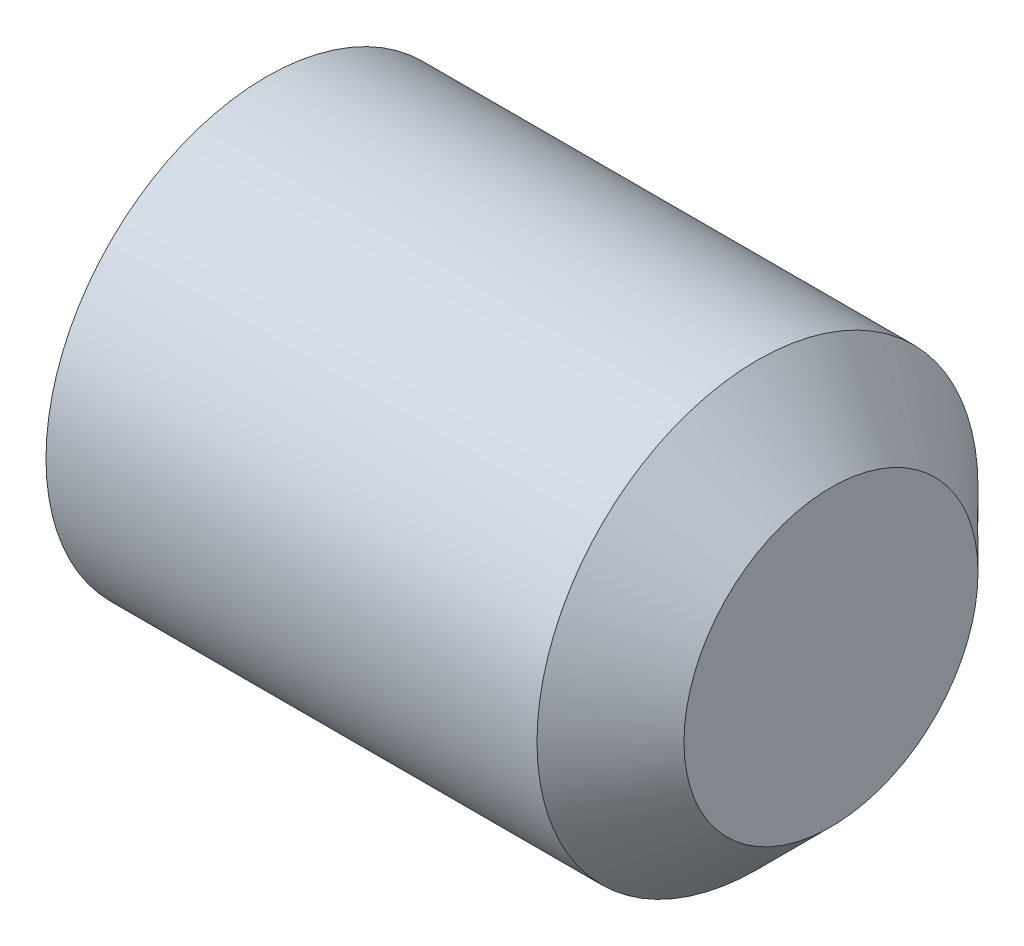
ISO-10303-21;
HEADER;
FILE_DESCRIPTION(('STEP AP214'),'2;1');
FILE_NAME('part.step','',(''),(''),'','','');
FILE_SCHEMA(('AUTOMOTIVE_DESIGN { 1 0 10303 214 1 1 1 1 }'));
ENDSEC;
DATA;
#1=APPLICATION_CONTEXT('core data for automotive mechanical design processes');
#2=APPLICATION_PROTOCOL_DEFINITION('international standard','automotive_design',2000,#1);
#3=PRODUCT_CONTEXT('',#1,'mechanical');
#4=PRODUCT('Part','Part','',(#3));
#5=PRODUCT_RELATED_PRODUCT_CATEGORY('part','',(#4));
#6=PRODUCT_DEFINITION_FORMATION('','',#4);
#7=PRODUCT_DEFINITION_CONTEXT('part definition',#1,'design');
#8=PRODUCT_DEFINITION('design','',#6,#7);
#9=PRODUCT_DEFINITION_SHAPE('','',#8);
#10=(LENGTH_UNIT() NAMED_UNIT(*) SI_UNIT(.MILLI.,.METRE.));
#11=(NAMED_UNIT(*) PLANE_ANGLE_UNIT() SI_UNIT($,.RADIAN.));
#12=(NAMED_UNIT(*) SI_UNIT($,.STERADIAN.) SOLID_ANGLE_UNIT());
#13=UNCERTAINTY_MEASURE_WITH_UNIT(LENGTH_MEASURE(1.E-05),#10,'distance_accuracy_value','');
#14=(GEOMETRIC_REPRESENTATION_CONTEXT(3) GLOBAL_UNCERTAINTY_ASSIGNED_CONTEXT((#13)) GLOBAL_UNIT_ASSIGNED_CONTEXT((#10,
#11,#12)) REPRESENTATION_CONTEXT('',''));
#15=CARTESIAN_POINT('',(0.,0.,0.));
#16=DIRECTION('',(0.,0.,1.));
#17=DIRECTION('',(1.,0.,0.));
#18=AXIS2_PLACEMENT_3D('',#15,#16,#17);
#19=CARTESIAN_POINT('',(0.,0.,0.));
#20=DIRECTION('',(-1.,0.,0.));
#21=DIRECTION('',(0.,0.,1.));
#22=AXIS2_PLACEMENT_3D('',#19,#20,#21);
#23=PLANE('',#22);
#24=CARTESIAN_POINT('',(0.,0.,0.));
#25=DIRECTION('',(-1.,0.,0.));
#26=DIRECTION('',(0.,0.,1.));
#27=AXIS2_PLACEMENT_3D('',#24,#25,#26);
#28=CIRCLE('',#27,2.4455);
#29=CARTESIAN_POINT('',(0.,0.,2.4455));
#30=VERTEX_POINT('',#29);
#31=EDGE_CURVE('E133',#30,#30,#28,.T.);
#32=ORIENTED_EDGE('',*,*,#31,.T.);
#33=EDGE_LOOP('',(#32));
#34=FACE_BOUND('',#33,.T.);
#35=DIRECTION('',(0.,0.,-1.));
#36=VECTOR('',#35,1.);
#37=CARTESIAN_POINT('',(0.,1.5,0.866025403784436));
#38=LINE('',#37,#36);
#39=CARTESIAN_POINT('',(0.,1.5,0.866025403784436));
#40=VERTEX_POINT('',#39);
#41=CARTESIAN_POINT('',(0.,1.5,-0.866025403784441));
#42=VERTEX_POINT('',#41);
#43=EDGE_CURVE('E124',#40,#42,#38,.T.);
#44=ORIENTED_EDGE('',*,*,#43,.F.);
#45=DIRECTION('',(0.,-0.866025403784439,0.5));
#46=VECTOR('',#45,1.);
#47=CARTESIAN_POINT('',(0.,1.5,0.866025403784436));
#48=LINE('',#47,#46);
#49=CARTESIAN_POINT('',(0.,0.,1.73205080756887));
#50=VERTEX_POINT('',#49);
#51=EDGE_CURVE('E46',#40,#50,#48,.T.);
#52=ORIENTED_EDGE('',*,*,#51,.T.);
#53=DIRECTION('',(0.,0.866025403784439,0.5));
#54=VECTOR('',#53,1.);
#55=CARTESIAN_POINT('',(0.,-1.5,0.866025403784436));
#56=LINE('',#55,#54);
#57=CARTESIAN_POINT('',(0.,-1.5,0.866025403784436));
#58=VERTEX_POINT('',#57);
#59=EDGE_CURVE('E115',#58,#50,#56,.T.);
#60=ORIENTED_EDGE('',*,*,#59,.F.);
#61=DIRECTION('',(0.,0.,-1.));
#62=VECTOR('',#61,1.);
#63=CARTESIAN_POINT('',(0.,-1.5,0.866025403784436));
#64=LINE('',#63,#62);
#65=CARTESIAN_POINT('',(0.,-1.5,-0.866025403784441));
#66=VERTEX_POINT('',#65);
#67=EDGE_CURVE('E118',#58,#66,#64,.T.);
#68=ORIENTED_EDGE('',*,*,#67,.T.);
#69=DIRECTION('',(0.,0.866025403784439,-0.5));
#70=VECTOR('',#69,1.);
#71=CARTESIAN_POINT('',(0.,-1.5,-0.866025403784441));
#72=LINE('',#71,#70);
#73=CARTESIAN_POINT('',(0.,0.,-1.73205080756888));
#74=VERTEX_POINT('',#73);
#75=EDGE_CURVE('E121',#66,#74,#72,.T.);
#76=ORIENTED_EDGE('',*,*,#75,.T.);
#77=DIRECTION('',(0.,-0.866025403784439,-0.5));
#78=VECTOR('',#77,1.);
#79=CARTESIAN_POINT('',(0.,1.5,-0.866025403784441));
#80=LINE('',#79,#78);
#81=EDGE_CURVE('E104',#42,#74,#80,.T.);
#82=ORIENTED_EDGE('',*,*,#81,.F.);
#83=EDGE_LOOP('',(#44,#52,#60,#68,#76,#82));
#84=FACE_BOUND('',#83,.T.);
#85=ADVANCED_FACE('F31',(#34,#84),#23,.T.);
#86=CARTESIAN_POINT('',(8.,2.,0.));
#87=DIRECTION('',(1.,0.,0.));
#88=DIRECTION('',(0.,0.,-1.));
#89=AXIS2_PLACEMENT_3D('',#86,#87,#88);
#90=PLANE('',#89);
#91=CARTESIAN_POINT('',(8.,0.,0.));
#92=DIRECTION('',(-1.,0.,0.));
#93=DIRECTION('',(0.,0.,1.));
#94=AXIS2_PLACEMENT_3D('',#91,#92,#93);
#95=CIRCLE('',#94,2.);
#96=CARTESIAN_POINT('',(8.,0.,2.));
#97=VERTEX_POINT('',#96);
#98=EDGE_CURVE('E11',#97,#97,#95,.T.);
#99=ORIENTED_EDGE('',*,*,#98,.F.);
#100=EDGE_LOOP('',(#99));
#101=FACE_BOUND('',#100,.T.);
#102=ADVANCED_FACE('F33',(#101),#90,.T.);
#103=CARTESIAN_POINT('',(7.00000000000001,0.,0.));
#104=DIRECTION('',(-1.,0.,0.));
#105=DIRECTION('',(0.,0.,1.));
#106=AXIS2_PLACEMENT_3D('',#103,#104,#105);
#107=CONICAL_SURFACE('',#106,3.,0.785398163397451);
#108=ORIENTED_EDGE('',*,*,#98,.T.);
#109=EDGE_LOOP('',(#108));
#110=FACE_BOUND('',#109,.T.);
#111=CARTESIAN_POINT('',(7.00000000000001,0.,0.));
#112=DIRECTION('',(-1.,0.,0.));
#113=DIRECTION('',(0.,0.,1.));
#114=AXIS2_PLACEMENT_3D('',#111,#112,#113);
#115=CIRCLE('',#114,3.);
#116=CARTESIAN_POINT('',(7.00000000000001,0.,3.));
#117=VERTEX_POINT('',#116);
#118=EDGE_CURVE('E39',#117,#117,#115,.T.);
#119=ORIENTED_EDGE('',*,*,#118,.F.);
#120=EDGE_LOOP('',(#119));
#121=FACE_BOUND('',#120,.T.);
#122=ADVANCED_FACE('F144',(#110,#121),#107,.T.);
#123=CARTESIAN_POINT('',(-12.7,0.,0.));
#124=DIRECTION('',(-1.,0.,0.));
#125=DIRECTION('',(0.,0.,1.));
#126=AXIS2_PLACEMENT_3D('',#123,#124,#125);
#127=CYLINDRICAL_SURFACE('',#126,3.);
#128=ORIENTED_EDGE('',*,*,#118,.T.);
#129=EDGE_LOOP('',(#128));
#130=FACE_BOUND('',#129,.T.);
#131=CARTESIAN_POINT('',(0.320140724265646,0.,0.));
#132=DIRECTION('',(-1.,0.,0.));
#133=DIRECTION('',(0.,0.,1.));
#134=AXIS2_PLACEMENT_3D('',#131,#132,#133);
#135=CIRCLE('',#134,3.);
#136=CARTESIAN_POINT('',(0.320140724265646,0.,3.));
#137=VERTEX_POINT('',#136);
#138=EDGE_CURVE('E136',#137,#137,#135,.T.);
#139=ORIENTED_EDGE('',*,*,#138,.F.);
#140=EDGE_LOOP('',(#139));
#141=FACE_BOUND('',#140,.T.);
#142=ADVANCED_FACE('F141',(#130,#141),#127,.T.);
#143=CARTESIAN_POINT('',(0.,0.,0.));
#144=DIRECTION('',(1.,0.,0.));
#145=DIRECTION('',(0.,0.,-1.));
#146=AXIS2_PLACEMENT_3D('',#143,#144,#145);
#147=CONICAL_SURFACE('',#146,2.4455,1.0471975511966);
#148=ORIENTED_EDGE('',*,*,#138,.T.);
#149=EDGE_LOOP('',(#148));
#150=FACE_BOUND('',#149,.T.);
#151=ORIENTED_EDGE('',*,*,#31,.F.);
#152=EDGE_LOOP('',(#151));
#153=FACE_BOUND('',#152,.T.);
#154=ADVANCED_FACE('F151',(#150,#153),#147,.T.);
#155=CARTESIAN_POINT('',(3.5,1.5,0.866025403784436));
#156=DIRECTION('',(0.,-0.5,-0.866025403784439));
#157=DIRECTION('',(0.,0.866025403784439,-0.5));
#158=AXIS2_PLACEMENT_3D('',#155,#156,#157);
#159=PLANE('',#158);
#160=ORIENTED_EDGE('',*,*,#51,.F.);
#161=DIRECTION('',(-1.,0.,0.));
#162=VECTOR('',#161,1.);
#163=CARTESIAN_POINT('',(3.5,1.5,0.866025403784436));
#164=LINE('',#163,#162);
#165=CARTESIAN_POINT('',(3.5,1.5,0.866025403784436));
#166=VERTEX_POINT('',#165);
#167=EDGE_CURVE('E51',#166,#40,#164,.T.);
#168=ORIENTED_EDGE('',*,*,#167,.F.);
#169=DIRECTION('',(0.,-0.866025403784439,0.5));
#170=VECTOR('',#169,1.);
#171=CARTESIAN_POINT('',(3.5,1.5,0.866025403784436));
#172=LINE('',#171,#170);
#173=CARTESIAN_POINT('',(3.5,0.,1.73205080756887));
#174=VERTEX_POINT('',#173);
#175=EDGE_CURVE('E78',#166,#174,#172,.T.);
#176=ORIENTED_EDGE('',*,*,#175,.T.);
#177=DIRECTION('',(-1.,0.,0.));
#178=VECTOR('',#177,1.);
#179=CARTESIAN_POINT('',(3.5,0.,1.73205080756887));
#180=LINE('',#179,#178);
#181=EDGE_CURVE('E131',#174,#50,#180,.T.);
#182=ORIENTED_EDGE('',*,*,#181,.T.);
#183=EDGE_LOOP('',(#160,#168,#176,#182));
#184=FACE_BOUND('',#183,.T.);
#185=ADVANCED_FACE('F162',(#184),#159,.T.);
#186=CARTESIAN_POINT('',(3.5,-1.5,0.866025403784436));
#187=DIRECTION('',(0.,-0.5,0.866025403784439));
#188=DIRECTION('',(0.,-0.866025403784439,-0.5));
#189=AXIS2_PLACEMENT_3D('',#186,#187,#188);
#190=PLANE('',#189);
#191=ORIENTED_EDGE('',*,*,#59,.T.);
#192=ORIENTED_EDGE('',*,*,#181,.F.);
#193=DIRECTION('',(0.,0.866025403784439,0.5));
#194=VECTOR('',#193,1.);
#195=CARTESIAN_POINT('',(3.5,-1.5,0.866025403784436));
#196=LINE('',#195,#194);
#197=CARTESIAN_POINT('',(3.5,-1.5,0.866025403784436));
#198=VERTEX_POINT('',#197);
#199=EDGE_CURVE('E260',#198,#174,#196,.T.);
#200=ORIENTED_EDGE('',*,*,#199,.F.);
#201=DIRECTION('',(-1.,0.,0.));
#202=VECTOR('',#201,1.);
#203=CARTESIAN_POINT('',(3.5,-1.5,0.866025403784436));
#204=LINE('',#203,#202);
#205=EDGE_CURVE('E129',#198,#58,#204,.T.);
#206=ORIENTED_EDGE('',*,*,#205,.T.);
#207=EDGE_LOOP('',(#191,#192,#200,#206));
#208=FACE_BOUND('',#207,.T.);
#209=ADVANCED_FACE('F169',(#208),#190,.F.);
#210=CARTESIAN_POINT('',(3.5,-1.5,0.866025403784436));
#211=DIRECTION('',(0.,1.,0.));
#212=DIRECTION('',(0.,0.,1.));
#213=AXIS2_PLACEMENT_3D('',#210,#211,#212);
#214=PLANE('',#213);
#215=ORIENTED_EDGE('',*,*,#67,.F.);
#216=ORIENTED_EDGE('',*,*,#205,.F.);
#217=DIRECTION('',(0.,0.,-1.));
#218=VECTOR('',#217,1.);
#219=CARTESIAN_POINT('',(3.5,-1.5,0.866025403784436));
#220=LINE('',#219,#218);
#221=CARTESIAN_POINT('',(3.5,-1.5,-0.866025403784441));
#222=VERTEX_POINT('',#221);
#223=EDGE_CURVE('E99',#198,#222,#220,.T.);
#224=ORIENTED_EDGE('',*,*,#223,.T.);
#225=DIRECTION('',(-1.,0.,0.));
#226=VECTOR('',#225,1.);
#227=CARTESIAN_POINT('',(3.5,-1.5,-0.866025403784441));
#228=LINE('',#227,#226);
#229=EDGE_CURVE('E94',#222,#66,#228,.T.);
#230=ORIENTED_EDGE('',*,*,#229,.T.);
#231=EDGE_LOOP('',(#215,#216,#224,#230));
#232=FACE_BOUND('',#231,.T.);
#233=ADVANCED_FACE('F176',(#232),#214,.T.);
#234=CARTESIAN_POINT('',(3.5,-1.5,-0.866025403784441));
#235=DIRECTION('',(0.,0.5,0.866025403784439));
#236=DIRECTION('',(0.,-0.866025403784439,0.5));
#237=AXIS2_PLACEMENT_3D('',#234,#235,#236);
#238=PLANE('',#237);
#239=ORIENTED_EDGE('',*,*,#75,.F.);
#240=ORIENTED_EDGE('',*,*,#229,.F.);
#241=DIRECTION('',(0.,0.866025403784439,-0.5));
#242=VECTOR('',#241,1.);
#243=CARTESIAN_POINT('',(3.5,-1.5,-0.866025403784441));
#244=LINE('',#243,#242);
#245=CARTESIAN_POINT('',(3.5,0.,-1.73205080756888));
#246=VERTEX_POINT('',#245);
#247=EDGE_CURVE('E89',#222,#246,#244,.T.);
#248=ORIENTED_EDGE('',*,*,#247,.T.);
#249=DIRECTION('',(-1.,0.,0.));
#250=VECTOR('',#249,1.);
#251=CARTESIAN_POINT('',(3.5,0.,-1.73205080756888));
#252=LINE('',#251,#250);
#253=EDGE_CURVE('E93',#246,#74,#252,.T.);
#254=ORIENTED_EDGE('',*,*,#253,.T.);
#255=EDGE_LOOP('',(#239,#240,#248,#254));
#256=FACE_BOUND('',#255,.T.);
#257=ADVANCED_FACE('F92',(#256),#238,.T.);
#258=CARTESIAN_POINT('',(3.5,1.5,-0.866025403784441));
#259=DIRECTION('',(0.,0.5,-0.866025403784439));
#260=DIRECTION('',(0.,0.866025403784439,0.5));
#261=AXIS2_PLACEMENT_3D('',#258,#259,#260);
#262=PLANE('',#261);
#263=ORIENTED_EDGE('',*,*,#81,.T.);
#264=ORIENTED_EDGE('',*,*,#253,.F.);
#265=DIRECTION('',(0.,-0.866025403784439,-0.5));
#266=VECTOR('',#265,1.);
#267=CARTESIAN_POINT('',(3.5,1.5,-0.866025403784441));
#268=LINE('',#267,#266);
#269=CARTESIAN_POINT('',(3.5,1.5,-0.866025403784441));
#270=VERTEX_POINT('',#269);
#271=EDGE_CURVE('E98',#270,#246,#268,.T.);
#272=ORIENTED_EDGE('',*,*,#271,.F.);
#273=DIRECTION('',(-1.,0.,0.));
#274=VECTOR('',#273,1.);
#275=CARTESIAN_POINT('',(3.5,1.5,-0.866025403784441));
#276=LINE('',#275,#274);
#277=EDGE_CURVE('E74',#270,#42,#276,.T.);
#278=ORIENTED_EDGE('',*,*,#277,.T.);
#279=EDGE_LOOP('',(#263,#264,#272,#278));
#280=FACE_BOUND('',#279,.T.);
#281=ADVANCED_FACE('F101',(#280),#262,.F.);
#282=CARTESIAN_POINT('',(3.5,1.5,0.866025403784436));
#283=DIRECTION('',(0.,1.,0.));
#284=DIRECTION('',(0.,0.,1.));
#285=AXIS2_PLACEMENT_3D('',#282,#283,#284);
#286=PLANE('',#285);
#287=ORIENTED_EDGE('',*,*,#43,.T.);
#288=ORIENTED_EDGE('',*,*,#277,.F.);
#289=DIRECTION('',(0.,0.,-1.));
#290=VECTOR('',#289,1.);
#291=CARTESIAN_POINT('',(3.5,1.5,0.866025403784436));
#292=LINE('',#291,#290);
#293=EDGE_CURVE('E109',#166,#270,#292,.T.);
#294=ORIENTED_EDGE('',*,*,#293,.F.);
#295=ORIENTED_EDGE('',*,*,#167,.T.);
#296=EDGE_LOOP('',(#287,#288,#294,#295));
#297=FACE_BOUND('',#296,.T.);
#298=ADVANCED_FACE('F188',(#297),#286,.F.);
#299=CARTESIAN_POINT('',(3.5,1.5,0.866025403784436));
#300=DIRECTION('',(1.,0.,0.));
#301=DIRECTION('',(0.,0.,-1.));
#302=AXIS2_PLACEMENT_3D('',#299,#300,#301);
#303=PLANE('',#302);
#304=ORIENTED_EDGE('',*,*,#175,.F.);
#305=ORIENTED_EDGE('',*,*,#293,.T.);
#306=ORIENTED_EDGE('',*,*,#271,.T.);
#307=ORIENTED_EDGE('',*,*,#247,.F.);
#308=ORIENTED_EDGE('',*,*,#223,.F.);
#309=ORIENTED_EDGE('',*,*,#199,.T.);
#310=EDGE_LOOP('',(#304,#305,#306,#307,#308,#309));
#311=FACE_BOUND('',#310,.T.);
#312=ADVANCED_FACE('F107',(#311),#303,.F.);
#313=CLOSED_SHELL('',(#85,#102,#122,#142,#154,#185,#209,#233,#257,#281,#298,#312));
#314=MANIFOLD_SOLID_BREP('B2',#313);
#315=ADVANCED_BREP_SHAPE_REPRESENTATION('',(#18,#314),#14);
#316=SHAPE_DEFINITION_REPRESENTATION(#9,#315);
ENDSEC;
END-ISO-10303-21;
